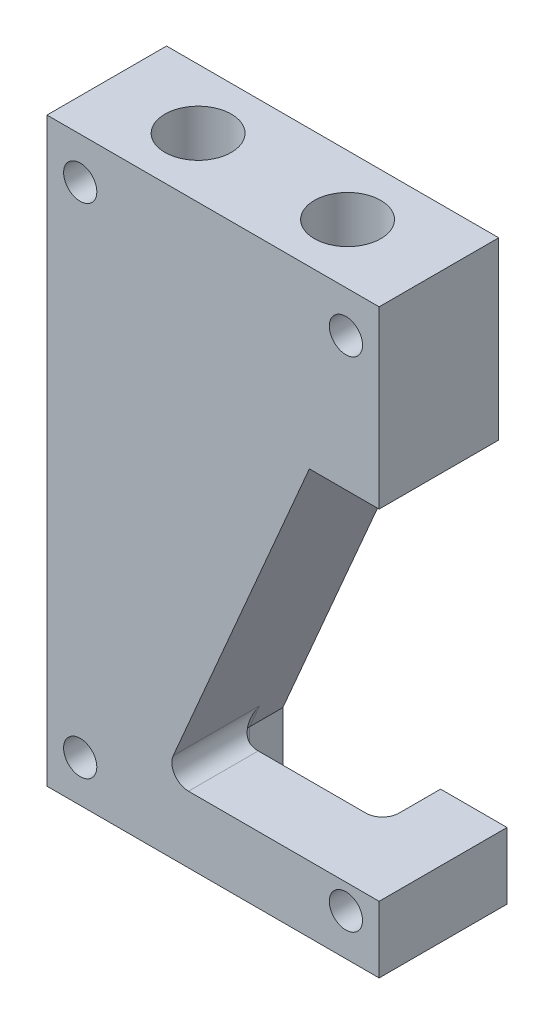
from build123d import *

# Parameters (mm, degrees)
IZIM1_W                     = 20
IZIM1_H                     = 7.2
Y_KSEKLIK_EKSTR_ZYON1_DEPTH = 35
IZIM2_R                     = 2
KES_EKSTR_ZYON1_DEPTH       = 7
IZIM3_R                     = 1
KES_EKSTR_ZYON7_DEPTH       = 38.105794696
KES_EKSTR_ZYON8_DEPTH       = 38.105794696
IZIM6_W                     = 4.2
IZIM6_H                     = 4
Y_KSEKLIK_EKSTR_ZYON2_DEPTH = 13
IZIM7_W                     = 4
IZIM7_H                     = 4
Y_KSEKLIK_EKSTR_ZYON3_DEPTH = 3.5
IZIM8_R                     = 1
KES_EKSTR_ZYON11_DEPTH      = 38.206047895
RADYUS3_R                   = 1
RADYUS4_R                   = 1
RADYUS5_R                   = 1


with BuildPart() as part:
    # izim1 → Y_kseklik-Ekstr_zyon1 (new body)
    with BuildSketch(Plane(origin=(0, 0, 0), x_dir=(1, 0, 0), z_dir=(0, 1, 0))):
        Rectangle(IZIM1_W, IZIM1_H)
    extrude(amount=Y_KSEKLIK_EKSTR_ZYON1_DEPTH)

    # izim2 → Kes-Ekstr_zyon1 (cut)
    with BuildSketch(Plane(origin=(0, 35, 0), x_dir=(1, 0, 0), z_dir=(0, 1, 0))):
        with Locations(Location((-4.5, 0, 0), (0, 0, 270))):
            Circle(IZIM2_R)
        with Locations(Location((4.5, 0, 0), (0, 0, 270))):
            Circle(IZIM2_R)
    extrude(amount=-KES_EKSTR_ZYON1_DEPTH, mode=Mode.SUBTRACT)

    # izim3 → Kes-Ekstr_zyon7 (cut, through all)
    with BuildSketch(Plane.XY.offset(3.6)):
        with Locations((-8, 32.5)):
            Circle(IZIM3_R)
        with Locations((8, 32.5)):
            Circle(IZIM3_R)
        with Locations((-8, 2.5)):
            Circle(IZIM3_R)
        with Locations((8, 2.5)):
            Circle(IZIM3_R)
    extrude(amount=-KES_EKSTR_ZYON7_DEPTH, mode=Mode.SUBTRACT)

    # izim4 → Kes-Ekstr_zyon8 (cut, through all)
    with BuildSketch(Plane.XY.offset(3.6)):
        Polygon((10, 24.45), (10, 0), (-3, 0), (-3, 4), (5.8, 24.45), align=None)
    extrude(amount=-KES_EKSTR_ZYON8_DEPTH, mode=Mode.SUBTRACT)

    # izim6 → Y_kseklik-Ekstr_zyon2 (add)
    with BuildSketch(Plane(origin=(-3, 0, 0), x_dir=(0, 0, -1), z_dir=(1, 0, 0))):
        with Locations((-1.5, 2)):
            Rectangle(IZIM6_W, IZIM6_H)
    extrude(amount=Y_KSEKLIK_EKSTR_ZYON2_DEPTH)

    # izim7 → Y_kseklik-Ekstr_zyon3 (add)
    with BuildSketch(Plane(origin=(0, 0, -0.6), x_dir=(-1, 0, 0), z_dir=(0, 0, -1))):
        with Locations((-8, 2)):
            Rectangle(IZIM7_W, IZIM7_H)
    extrude(amount=Y_KSEKLIK_EKSTR_ZYON3_DEPTH)

    # izim8 → Kes-Ekstr_zyon11 (cut, through all)
    with BuildSketch(Plane.XY.offset(3.6)):
        with Locations((8, 2.5)):
            Circle(IZIM8_R)
    extrude(amount=-KES_EKSTR_ZYON11_DEPTH, mode=Mode.SUBTRACT)

    # Radyus3
    radyus3_edges = [part.edges().sort_by_distance(p)[0] for p in [
        (-3, 4, 1.5),
    ]]
    fillet(radyus3_edges, radius=RADYUS3_R)

    # Radyus4
    radyus4_edges = [part.edges().sort_by_distance(p)[0] for p in [
        (-2.699794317, 4.69763707, -0.6),
        (-3, 2, -0.6),
    ]]
    fillet(radyus4_edges, radius=RADYUS4_R)

    # Radyus5
    radyus5_edges = [part.edges().sort_by_distance(p)[0] for p in [
        (6, 2, -0.6),
    ]]
    fillet(radyus5_edges, radius=RADYUS5_R)


solid = part.part
